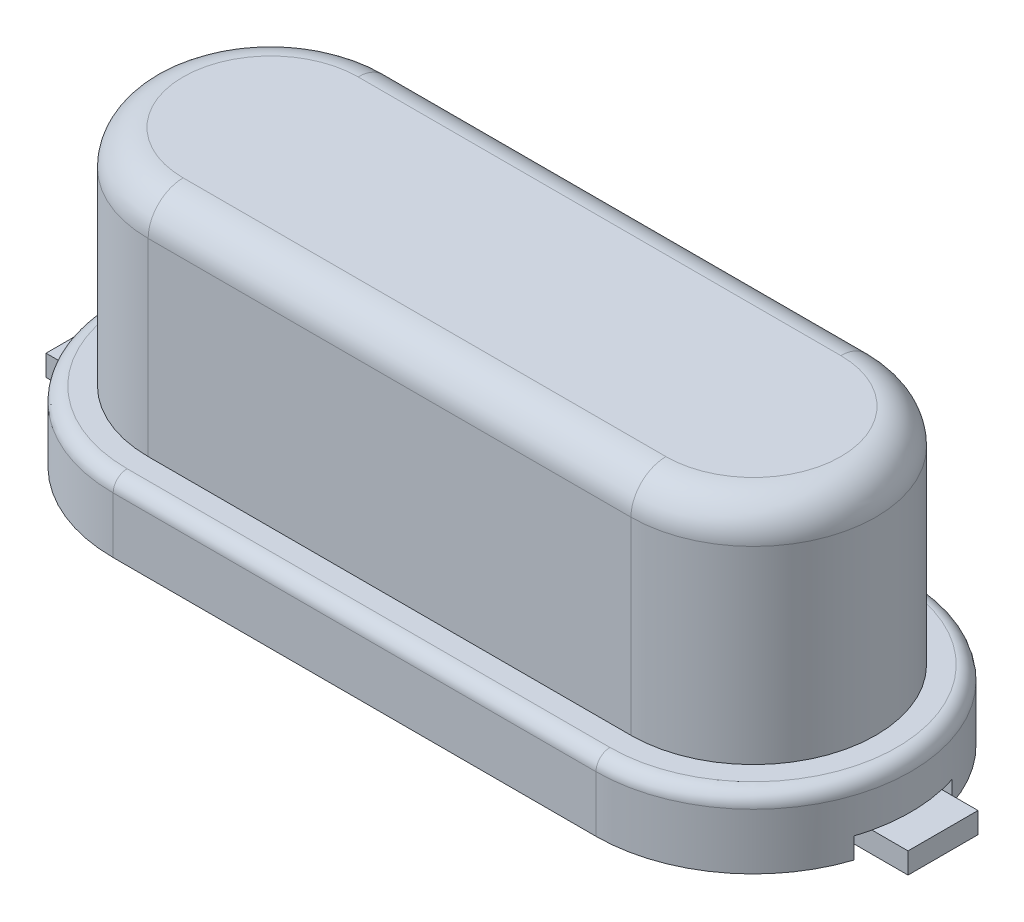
from build123d import *
from build123d.topology import SkipClean

# Parameters (mm, degrees)
SKETCH_1_W        = 4.32
SKETCH_1_H        = 1
EXTRUDE_1_DEPTH   = 0.3
EXTRUDE_1_2_DEPTH = 0.3
EXTRUDE_2_DEPTH   = 0.3
EXTRUDE_3_DEPTH   = 0.7
EXTRUDE_4_DEPTH   = 3.2
FILLET_1_R        = 0.2
FILLET_2_R        = 0.5


with BuildPart() as part:
    # Sketch 1 → Extrude 1 (new body)
    with BuildSketch(Plane(origin=(0, 0, 0), x_dir=(1, 0, 0), z_dir=(0, 1, 0))):
        with Locations((-4, 0)):
            Rectangle(SKETCH_1_W, SKETCH_1_H)
    extrude(amount=EXTRUDE_1_DEPTH)



with BuildPart() as body_2:
    # Sketch 1 → Extrude 1 2 (new body)
    with BuildSketch(Plane(origin=(0, 0, 0), x_dir=(1, 0, 0), z_dir=(0, 1, 0))):
        with Locations((4, 0)):
            Rectangle(SKETCH_1_W, SKETCH_1_H)
    extrude(amount=EXTRUDE_1_2_DEPTH)


with BuildPart() as body_3:
    # Sketch 2 → Extrude 2 (new body)
    with BuildSketch(Plane(origin=(0, 0, 0), x_dir=(1, 0, 0), z_dir=(0, 1, 0))):
        with BuildLine():
            Line((1.64, 0.7), (1.64, -0.7))
            Line((1.64, -0.7), (5.588340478, -0.7))
            ThreePointArc((5.588340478, -0.7), (4.770511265, -1.82174367), (3.45, -2.25))
            Line((3.45, -2.25), (-3.45, -2.25))
            ThreePointArc((-3.45, -2.25), (-4.770511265, -1.82174367), (-5.588340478, -0.7))
            Line((-5.588340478, -0.7), (-1.64, -0.7))
            Line((-1.64, -0.7), (-1.64, 0.7))
            Line((-1.64, 0.7), (-5.588340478, 0.7))
            ThreePointArc((-5.588340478, 0.7), (-4.770511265, 1.82174367), (-3.45, 2.25))
            Line((-3.45, 2.25), (3.45, 2.25))
            ThreePointArc((3.45, 2.25), (4.770511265, 1.82174367), (5.588340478, 0.7))
            Line((5.588340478, 0.7), (1.64, 0.7))
        make_face()
    extrude(amount=EXTRUDE_2_DEPTH)


with BuildPart() as part_1:
    with SkipClean():  # the faces are left unmerged after this step: merging them gives an invalid solid
        add(part.part)

        add(body_2.part)  # Extrude 3 merges body 2

        add(body_3.part)  # Extrude 3 merges body 3
        # Sketch 3 → Extrude 3 (add)
        with BuildSketch(Plane(origin=(0, 0.3, 0), x_dir=(-1, 0, 0), z_dir=(0, 1, 0))):
            with BuildLine():
                Line((-3.45, -2.25), (3.45, -2.25))
                ThreePointArc((3.45, -2.25), (5.7, 0), (3.45, 2.25))
                Line((3.45, 2.25), (-3.45, 2.25))
                ThreePointArc((-3.45, 2.25), (-5.7, 0), (-3.45, -2.25))
            make_face()
        extrude(amount=EXTRUDE_3_DEPTH)

    # Sketch 4 → Extrude 4 (add)
    with SkipClean():  # the faces are left unmerged after this step: merging them gives an invalid solid
        with BuildSketch(Plane(origin=(0, 1, 0), x_dir=(-1, 0, 0), z_dir=(0, 1, 0))):
            with BuildLine():
                Line((-3.45, -1.75), (3.45, -1.75))
                ThreePointArc((3.45, -1.75), (5.2, 0), (3.45, 1.75))
                Line((3.45, 1.75), (-3.45, 1.75))
                ThreePointArc((-3.45, 1.75), (-5.2, 0), (-3.45, -1.75))
            make_face()
        extrude(amount=EXTRUDE_4_DEPTH)

    # Fillet 1
    fillet_1_edges = [part_1.edges().sort_by_distance(p)[0] for p in [
        (5.7, 1, 0),
        (0, 1, -2.25),
        (-5.7, 1, 0),
        (0, 1, 2.25),
    ]]
    fillet(fillet_1_edges, radius=FILLET_1_R)

    # Fillet 2
    fillet_2_edges = [part_1.edges().sort_by_distance(p)[0] for p in [
        (0, 4.2, 1.75),
        (5.2, 4.2, 0),
        (0, 4.2, -1.75),
        (-5.2, 4.2, 0),
    ]]
    fillet(fillet_2_edges, radius=FILLET_2_R)


solid = part_1.part
